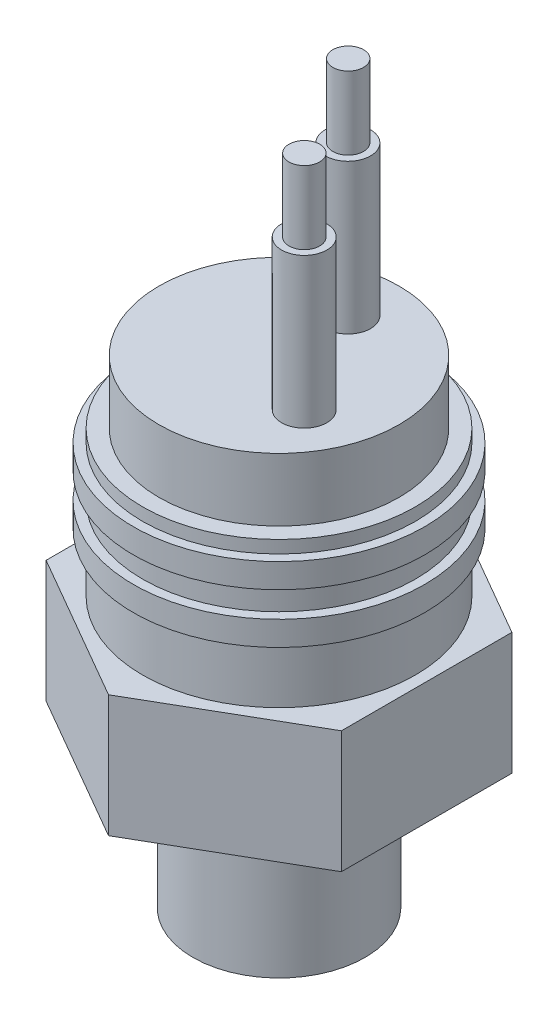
ISO-10303-21;
HEADER;
FILE_DESCRIPTION(('STEP AP214'),'2;1');
FILE_NAME('part.step','',(''),(''),'','','');
FILE_SCHEMA(('AUTOMOTIVE_DESIGN { 1 0 10303 214 1 1 1 1 }'));
ENDSEC;
DATA;
#1=APPLICATION_CONTEXT('core data for automotive mechanical design processes');
#2=APPLICATION_PROTOCOL_DEFINITION('international standard','automotive_design',2000,#1);
#3=PRODUCT_CONTEXT('',#1,'mechanical');
#4=PRODUCT('Part','Part','',(#3));
#5=PRODUCT_RELATED_PRODUCT_CATEGORY('part','',(#4));
#6=PRODUCT_DEFINITION_FORMATION('','',#4);
#7=PRODUCT_DEFINITION_CONTEXT('part definition',#1,'design');
#8=PRODUCT_DEFINITION('design','',#6,#7);
#9=PRODUCT_DEFINITION_SHAPE('','',#8);
#10=(LENGTH_UNIT() NAMED_UNIT(*) SI_UNIT(.MILLI.,.METRE.));
#11=(NAMED_UNIT(*) PLANE_ANGLE_UNIT() SI_UNIT($,.RADIAN.));
#12=(NAMED_UNIT(*) SI_UNIT($,.STERADIAN.) SOLID_ANGLE_UNIT());
#13=UNCERTAINTY_MEASURE_WITH_UNIT(LENGTH_MEASURE(1.E-05),#10,'distance_accuracy_value','');
#14=(GEOMETRIC_REPRESENTATION_CONTEXT(3) GLOBAL_UNCERTAINTY_ASSIGNED_CONTEXT((#13)) GLOBAL_UNIT_ASSIGNED_CONTEXT((#10,
#11,#12)) REPRESENTATION_CONTEXT('',''));
#15=CARTESIAN_POINT('',(0.,0.,0.));
#16=DIRECTION('',(0.,0.,1.));
#17=DIRECTION('',(1.,0.,0.));
#18=AXIS2_PLACEMENT_3D('',#15,#16,#17);
#19=CARTESIAN_POINT('',(-9.52499999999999,0.,-16.4977839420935));
#20=DIRECTION('',(0.,1.,0.));
#21=DIRECTION('',(0.,0.,1.));
#22=AXIS2_PLACEMENT_3D('',#19,#20,#21);
#23=PLANE('',#22);
#24=DIRECTION('',(-0.866025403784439,0.,-0.5));
#25=VECTOR('',#24,1.);
#26=CARTESIAN_POINT('',(9.52499999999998,0.,-5.4992613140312));
#27=LINE('',#26,#25);
#28=CARTESIAN_POINT('',(9.52499999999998,0.,-5.4992613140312));
#29=VERTEX_POINT('',#28);
#30=CARTESIAN_POINT('',(0.,0.,-10.9985226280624));
#31=VERTEX_POINT('',#30);
#32=EDGE_CURVE('E94',#29,#31,#27,.T.);
#33=ORIENTED_EDGE('',*,*,#32,.F.);
#34=DIRECTION('',(0.,0.,-1.));
#35=VECTOR('',#34,1.);
#36=CARTESIAN_POINT('',(9.52499999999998,0.,5.49926131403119));
#37=LINE('',#36,#35);
#38=CARTESIAN_POINT('',(9.52499999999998,0.,5.49926131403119));
#39=VERTEX_POINT('',#38);
#40=EDGE_CURVE('E124',#39,#29,#37,.T.);
#41=ORIENTED_EDGE('',*,*,#40,.F.);
#42=DIRECTION('',(0.866025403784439,0.,-0.5));
#43=VECTOR('',#42,1.);
#44=CARTESIAN_POINT('',(0.,0.,10.9985226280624));
#45=LINE('',#44,#43);
#46=CARTESIAN_POINT('',(0.,0.,10.9985226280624));
#47=VERTEX_POINT('',#46);
#48=EDGE_CURVE('E122',#47,#39,#45,.T.);
#49=ORIENTED_EDGE('',*,*,#48,.F.);
#50=DIRECTION('',(0.866025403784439,0.,0.5));
#51=VECTOR('',#50,1.);
#52=CARTESIAN_POINT('',(-9.52499999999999,0.,5.49926131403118));
#53=LINE('',#52,#51);
#54=CARTESIAN_POINT('',(-9.52499999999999,0.,5.49926131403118));
#55=VERTEX_POINT('',#54);
#56=EDGE_CURVE('E120',#55,#47,#53,.T.);
#57=ORIENTED_EDGE('',*,*,#56,.F.);
#58=DIRECTION('',(0.,0.,1.));
#59=VECTOR('',#58,1.);
#60=CARTESIAN_POINT('',(-9.52499999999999,0.,-5.49926131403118));
#61=LINE('',#60,#59);
#62=CARTESIAN_POINT('',(-9.52499999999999,0.,-5.49926131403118));
#63=VERTEX_POINT('',#62);
#64=EDGE_CURVE('E96',#63,#55,#61,.T.);
#65=ORIENTED_EDGE('',*,*,#64,.F.);
#66=DIRECTION('',(-0.866025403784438,0.,0.5));
#67=VECTOR('',#66,1.);
#68=CARTESIAN_POINT('',(0.,0.,-10.9985226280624));
#69=LINE('',#68,#67);
#70=EDGE_CURVE('E89',#31,#63,#69,.T.);
#71=ORIENTED_EDGE('',*,*,#70,.F.);
#72=EDGE_LOOP('',(#33,#41,#49,#57,#65,#71));
#73=FACE_BOUND('',#72,.T.);
#74=CARTESIAN_POINT('',(0.,0.,0.));
#75=DIRECTION('',(0.,1.,0.));
#76=DIRECTION('',(0.,0.,1.));
#77=AXIS2_PLACEMENT_3D('',#74,#75,#76);
#78=CIRCLE('',#77,7.94336420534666);
#79=CARTESIAN_POINT('',(0.,0.,7.94336420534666));
#80=VERTEX_POINT('',#79);
#81=EDGE_CURVE('E11',#80,#80,#78,.F.);
#82=ORIENTED_EDGE('',*,*,#81,.F.);
#83=EDGE_LOOP('',(#82));
#84=FACE_BOUND('',#83,.T.);
#85=ADVANCED_FACE('F36',(#73,#84),#23,.F.);
#86=CARTESIAN_POINT('',(3.84948291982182,30.988,2.22250000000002));
#87=DIRECTION('',(0.,1.,0.));
#88=DIRECTION('',(0.500000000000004,0.,-0.866025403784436));
#89=AXIS2_PLACEMENT_3D('',#86,#87,#88);
#90=PLANE('',#89);
#91=CARTESIAN_POINT('',(3.84948291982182,30.988,2.22250000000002));
#92=DIRECTION('',(0.,1.,0.));
#93=DIRECTION('',(0.500000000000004,0.,-0.866025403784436));
#94=AXIS2_PLACEMENT_3D('',#91,#92,#93);
#95=CIRCLE('',#94,1.4605);
#96=CARTESIAN_POINT('',(4.57973291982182,30.988,0.957669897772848));
#97=VERTEX_POINT('',#96);
#98=EDGE_CURVE('E303',#97,#97,#95,.T.);
#99=ORIENTED_EDGE('',*,*,#98,.T.);
#100=EDGE_LOOP('',(#99));
#101=FACE_BOUND('',#100,.T.);
#102=CARTESIAN_POINT('',(3.86587986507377,30.988,2.23196678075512));
#103=DIRECTION('',(0.,1.,0.));
#104=DIRECTION('',(0.500000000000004,0.,-0.866025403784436));
#105=AXIS2_PLACEMENT_3D('',#102,#103,#104);
#106=CIRCLE('',#105,0.9906);
#107=CARTESIAN_POINT('',(4.36117986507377,30.988,1.37408201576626));
#108=VERTEX_POINT('',#107);
#109=EDGE_CURVE('E309',#108,#108,#106,.T.);
#110=ORIENTED_EDGE('',*,*,#109,.F.);
#111=EDGE_LOOP('',(#110));
#112=FACE_BOUND('',#111,.T.);
#113=ADVANCED_FACE('F171',(#101,#112),#90,.T.);
#114=CARTESIAN_POINT('',(0.,21.336,0.));
#115=DIRECTION('',(0.,1.,0.));
#116=DIRECTION('',(-1.,0.,0.));
#117=AXIS2_PLACEMENT_3D('',#114,#115,#116);
#118=PLANE('',#117);
#119=CARTESIAN_POINT('',(0.,21.336,-4.445));
#120=DIRECTION('',(0.,1.,0.));
#121=DIRECTION('',(-1.,0.,0.));
#122=AXIS2_PLACEMENT_3D('',#119,#120,#121);
#123=CIRCLE('',#122,1.4605);
#124=CARTESIAN_POINT('',(-1.4605,21.336,-4.445));
#125=VERTEX_POINT('',#124);
#126=EDGE_CURVE('E294',#125,#125,#123,.T.);
#127=ORIENTED_EDGE('',*,*,#126,.F.);
#128=EDGE_LOOP('',(#127));
#129=FACE_BOUND('',#128,.T.);
#130=CARTESIAN_POINT('',(0.,21.336,0.));
#131=DIRECTION('',(0.,1.,0.));
#132=DIRECTION('',(-1.,0.,0.));
#133=AXIS2_PLACEMENT_3D('',#130,#131,#132);
#134=CIRCLE('',#133,7.747);
#135=CARTESIAN_POINT('',(-7.747,21.336,0.));
#136=VERTEX_POINT('',#135);
#137=EDGE_CURVE('E288',#136,#136,#134,.T.);
#138=ORIENTED_EDGE('',*,*,#137,.T.);
#139=EDGE_LOOP('',(#138));
#140=FACE_BOUND('',#139,.T.);
#141=CARTESIAN_POINT('',(3.84948291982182,21.336,2.22250000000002));
#142=DIRECTION('',(0.,1.,0.));
#143=DIRECTION('',(0.500000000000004,0.,-0.866025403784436));
#144=AXIS2_PLACEMENT_3D('',#141,#142,#143);
#145=CIRCLE('',#144,1.4605);
#146=CARTESIAN_POINT('',(4.57973291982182,21.336,0.957669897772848));
#147=VERTEX_POINT('',#146);
#148=EDGE_CURVE('E304',#147,#147,#145,.T.);
#149=ORIENTED_EDGE('',*,*,#148,.F.);
#150=EDGE_LOOP('',(#149));
#151=FACE_BOUND('',#150,.T.);
#152=ADVANCED_FACE('F175',(#129,#140,#151),#118,.T.);
#153=CARTESIAN_POINT('',(0.,30.988,-4.445));
#154=DIRECTION('',(0.,1.,0.));
#155=DIRECTION('',(-1.,0.,0.));
#156=AXIS2_PLACEMENT_3D('',#153,#154,#155);
#157=PLANE('',#156);
#158=CARTESIAN_POINT('',(0.,30.988,-4.445));
#159=DIRECTION('',(0.,1.,0.));
#160=DIRECTION('',(-1.,0.,0.));
#161=AXIS2_PLACEMENT_3D('',#158,#159,#160);
#162=CIRCLE('',#161,1.4605);
#163=CARTESIAN_POINT('',(-1.4605,30.988,-4.445));
#164=VERTEX_POINT('',#163);
#165=EDGE_CURVE('E291',#164,#164,#162,.T.);
#166=ORIENTED_EDGE('',*,*,#165,.T.);
#167=EDGE_LOOP('',(#166));
#168=FACE_BOUND('',#167,.T.);
#169=CARTESIAN_POINT('',(0.,30.988,-4.4639335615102));
#170=DIRECTION('',(0.,1.,0.));
#171=DIRECTION('',(-1.,0.,0.));
#172=AXIS2_PLACEMENT_3D('',#169,#170,#171);
#173=CIRCLE('',#172,0.9906);
#174=CARTESIAN_POINT('',(-0.990600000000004,30.988,-4.4639335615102));
#175=VERTEX_POINT('',#174);
#176=EDGE_CURVE('E300',#175,#175,#173,.T.);
#177=ORIENTED_EDGE('',*,*,#176,.F.);
#178=EDGE_LOOP('',(#177));
#179=FACE_BOUND('',#178,.T.);
#180=ADVANCED_FACE('F181',(#168,#179),#157,.T.);
#181=CARTESIAN_POINT('',(8.8011,17.272,0.));
#182=DIRECTION('',(0.,-1.,0.));
#183=DIRECTION('',(1.,0.,0.));
#184=AXIS2_PLACEMENT_3D('',#181,#182,#183);
#185=PLANE('',#184);
#186=CARTESIAN_POINT('',(0.,17.272,0.));
#187=DIRECTION('',(0.,1.,0.));
#188=DIRECTION('',(-1.,0.,0.));
#189=AXIS2_PLACEMENT_3D('',#186,#187,#188);
#190=CIRCLE('',#189,8.8011);
#191=CARTESIAN_POINT('',(-8.8011,17.272,0.));
#192=VERTEX_POINT('',#191);
#193=EDGE_CURVE('E112',#192,#192,#190,.T.);
#194=ORIENTED_EDGE('',*,*,#193,.T.);
#195=EDGE_LOOP('',(#194));
#196=FACE_BOUND('',#195,.T.);
#197=CARTESIAN_POINT('',(0.,17.272,0.));
#198=DIRECTION('',(0.,-1.,0.));
#199=DIRECTION('',(1.,0.,0.));
#200=AXIS2_PLACEMENT_3D('',#197,#198,#199);
#201=CIRCLE('',#200,7.747);
#202=CARTESIAN_POINT('',(7.747,17.272,0.));
#203=VERTEX_POINT('',#202);
#204=EDGE_CURVE('E107',#203,#203,#201,.F.);
#205=ORIENTED_EDGE('',*,*,#204,.F.);
#206=EDGE_LOOP('',(#205));
#207=FACE_BOUND('',#206,.T.);
#208=ADVANCED_FACE('F205',(#196,#207),#185,.F.);
#209=CARTESIAN_POINT('',(-9.52499999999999,7.874,-16.4977839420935));
#210=DIRECTION('',(0.,1.,0.));
#211=DIRECTION('',(0.,0.,1.));
#212=AXIS2_PLACEMENT_3D('',#209,#210,#211);
#213=PLANE('',#212);
#214=DIRECTION('',(-0.866025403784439,0.,-0.5));
#215=VECTOR('',#214,1.);
#216=CARTESIAN_POINT('',(9.52499999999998,7.874,-5.4992613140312));
#217=LINE('',#216,#215);
#218=CARTESIAN_POINT('',(9.52499999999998,7.874,-5.4992613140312));
#219=VERTEX_POINT('',#218);
#220=CARTESIAN_POINT('',(0.,7.874,-10.9985226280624));
#221=VERTEX_POINT('',#220);
#222=EDGE_CURVE('E126',#219,#221,#217,.T.);
#223=ORIENTED_EDGE('',*,*,#222,.T.);
#224=DIRECTION('',(-0.866025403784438,0.,0.5));
#225=VECTOR('',#224,1.);
#226=CARTESIAN_POINT('',(0.,7.874,-10.9985226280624));
#227=LINE('',#226,#225);
#228=CARTESIAN_POINT('',(-9.52499999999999,7.874,-5.49926131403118));
#229=VERTEX_POINT('',#228);
#230=EDGE_CURVE('E104',#221,#229,#227,.T.);
#231=ORIENTED_EDGE('',*,*,#230,.T.);
#232=DIRECTION('',(0.,0.,1.));
#233=VECTOR('',#232,1.);
#234=CARTESIAN_POINT('',(-9.52499999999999,7.874,-5.49926131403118));
#235=LINE('',#234,#233);
#236=CARTESIAN_POINT('',(-9.52499999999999,7.874,5.49926131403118));
#237=VERTEX_POINT('',#236);
#238=EDGE_CURVE('E129',#229,#237,#235,.T.);
#239=ORIENTED_EDGE('',*,*,#238,.T.);
#240=DIRECTION('',(0.866025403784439,0.,0.5));
#241=VECTOR('',#240,1.);
#242=CARTESIAN_POINT('',(-9.52499999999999,7.874,5.49926131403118));
#243=LINE('',#242,#241);
#244=CARTESIAN_POINT('',(0.,7.874,10.9985226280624));
#245=VERTEX_POINT('',#244);
#246=EDGE_CURVE('E131',#237,#245,#243,.T.);
#247=ORIENTED_EDGE('',*,*,#246,.T.);
#248=DIRECTION('',(0.866025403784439,0.,-0.5));
#249=VECTOR('',#248,1.);
#250=CARTESIAN_POINT('',(0.,7.874,10.9985226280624));
#251=LINE('',#250,#249);
#252=CARTESIAN_POINT('',(9.52499999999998,7.874,5.49926131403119));
#253=VERTEX_POINT('',#252);
#254=EDGE_CURVE('E56',#245,#253,#251,.T.);
#255=ORIENTED_EDGE('',*,*,#254,.T.);
#256=DIRECTION('',(0.,0.,-1.));
#257=VECTOR('',#256,1.);
#258=CARTESIAN_POINT('',(9.52499999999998,7.874,5.49926131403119));
#259=LINE('',#258,#257);
#260=EDGE_CURVE('E51',#253,#219,#259,.T.);
#261=ORIENTED_EDGE('',*,*,#260,.T.);
#262=EDGE_LOOP('',(#223,#231,#239,#247,#255,#261));
#263=FACE_BOUND('',#262,.T.);
#264=CARTESIAN_POINT('',(0.,7.874,0.));
#265=DIRECTION('',(0.,1.,0.));
#266=DIRECTION('',(-1.,0.,0.));
#267=AXIS2_PLACEMENT_3D('',#264,#265,#266);
#268=CIRCLE('',#267,8.8011);
#269=CARTESIAN_POINT('',(-8.8011,7.874,0.));
#270=VERTEX_POINT('',#269);
#271=EDGE_CURVE('E285',#270,#270,#268,.T.);
#272=ORIENTED_EDGE('',*,*,#271,.F.);
#273=EDGE_LOOP('',(#272));
#274=FACE_BOUND('',#273,.T.);
#275=ADVANCED_FACE('F251',(#263,#274),#213,.T.);
#276=CARTESIAN_POINT('',(9.52499999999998,7.874,-5.4992613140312));
#277=DIRECTION('',(-0.5,0.,0.866025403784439));
#278=DIRECTION('',(0.866025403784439,0.,0.5));
#279=AXIS2_PLACEMENT_3D('',#276,#277,#278);
#280=PLANE('',#279);
#281=ORIENTED_EDGE('',*,*,#32,.T.);
#282=DIRECTION('',(0.,-1.,0.));
#283=VECTOR('',#282,1.);
#284=CARTESIAN_POINT('',(0.,7.874,-10.9985226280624));
#285=LINE('',#284,#283);
#286=EDGE_CURVE('E102',#221,#31,#285,.T.);
#287=ORIENTED_EDGE('',*,*,#286,.F.);
#288=ORIENTED_EDGE('',*,*,#222,.F.);
#289=DIRECTION('',(0.,-1.,0.));
#290=VECTOR('',#289,1.);
#291=CARTESIAN_POINT('',(9.52499999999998,7.874,-5.4992613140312));
#292=LINE('',#291,#290);
#293=EDGE_CURVE('E111',#219,#29,#292,.T.);
#294=ORIENTED_EDGE('',*,*,#293,.T.);
#295=EDGE_LOOP('',(#281,#287,#288,#294));
#296=FACE_BOUND('',#295,.T.);
#297=ADVANCED_FACE('F38',(#296),#280,.F.);
#298=CARTESIAN_POINT('',(0.,7.874,-10.9985226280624));
#299=DIRECTION('',(0.5,0.,0.866025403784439));
#300=DIRECTION('',(0.866025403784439,0.,-0.5));
#301=AXIS2_PLACEMENT_3D('',#298,#299,#300);
#302=PLANE('',#301);
#303=ORIENTED_EDGE('',*,*,#70,.T.);
#304=DIRECTION('',(0.,-1.,0.));
#305=VECTOR('',#304,1.);
#306=CARTESIAN_POINT('',(-9.52499999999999,7.874,-5.49926131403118));
#307=LINE('',#306,#305);
#308=EDGE_CURVE('E108',#229,#63,#307,.T.);
#309=ORIENTED_EDGE('',*,*,#308,.F.);
#310=ORIENTED_EDGE('',*,*,#230,.F.);
#311=ORIENTED_EDGE('',*,*,#286,.T.);
#312=EDGE_LOOP('',(#303,#309,#310,#311));
#313=FACE_BOUND('',#312,.T.);
#314=ADVANCED_FACE('F103',(#313),#302,.F.);
#315=CARTESIAN_POINT('',(-9.52499999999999,7.874,-5.49926131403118));
#316=DIRECTION('',(1.,0.,0.));
#317=DIRECTION('',(0.,0.,-1.));
#318=AXIS2_PLACEMENT_3D('',#315,#316,#317);
#319=PLANE('',#318);
#320=ORIENTED_EDGE('',*,*,#64,.T.);
#321=DIRECTION('',(0.,-1.,0.));
#322=VECTOR('',#321,1.);
#323=CARTESIAN_POINT('',(-9.52499999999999,7.874,5.49926131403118));
#324=LINE('',#323,#322);
#325=EDGE_CURVE('E142',#237,#55,#324,.T.);
#326=ORIENTED_EDGE('',*,*,#325,.F.);
#327=ORIENTED_EDGE('',*,*,#238,.F.);
#328=ORIENTED_EDGE('',*,*,#308,.T.);
#329=EDGE_LOOP('',(#320,#326,#327,#328));
#330=FACE_BOUND('',#329,.T.);
#331=ADVANCED_FACE('F418',(#330),#319,.F.);
#332=CARTESIAN_POINT('',(-9.52499999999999,7.874,5.49926131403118));
#333=DIRECTION('',(0.5,0.,-0.866025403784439));
#334=DIRECTION('',(-0.866025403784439,0.,-0.5));
#335=AXIS2_PLACEMENT_3D('',#332,#333,#334);
#336=PLANE('',#335);
#337=ORIENTED_EDGE('',*,*,#56,.T.);
#338=DIRECTION('',(0.,-1.,0.));
#339=VECTOR('',#338,1.);
#340=CARTESIAN_POINT('',(0.,7.874,10.9985226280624));
#341=LINE('',#340,#339);
#342=EDGE_CURVE('E139',#245,#47,#341,.T.);
#343=ORIENTED_EDGE('',*,*,#342,.F.);
#344=ORIENTED_EDGE('',*,*,#246,.F.);
#345=ORIENTED_EDGE('',*,*,#325,.T.);
#346=EDGE_LOOP('',(#337,#343,#344,#345));
#347=FACE_BOUND('',#346,.T.);
#348=ADVANCED_FACE('F410',(#347),#336,.F.);
#349=CARTESIAN_POINT('',(0.,7.874,10.9985226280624));
#350=DIRECTION('',(-0.5,0.,-0.866025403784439));
#351=DIRECTION('',(-0.866025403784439,0.,0.5));
#352=AXIS2_PLACEMENT_3D('',#349,#350,#351);
#353=PLANE('',#352);
#354=ORIENTED_EDGE('',*,*,#48,.T.);
#355=DIRECTION('',(0.,-1.,0.));
#356=VECTOR('',#355,1.);
#357=CARTESIAN_POINT('',(9.52499999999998,7.874,5.49926131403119));
#358=LINE('',#357,#356);
#359=EDGE_CURVE('E136',#253,#39,#358,.T.);
#360=ORIENTED_EDGE('',*,*,#359,.F.);
#361=ORIENTED_EDGE('',*,*,#254,.F.);
#362=ORIENTED_EDGE('',*,*,#342,.T.);
#363=EDGE_LOOP('',(#354,#360,#361,#362));
#364=FACE_BOUND('',#363,.T.);
#365=ADVANCED_FACE('F402',(#364),#353,.F.);
#366=CARTESIAN_POINT('',(9.52499999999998,7.874,5.49926131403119));
#367=DIRECTION('',(-1.,0.,0.));
#368=DIRECTION('',(0.,0.,1.));
#369=AXIS2_PLACEMENT_3D('',#366,#367,#368);
#370=PLANE('',#369);
#371=ORIENTED_EDGE('',*,*,#40,.T.);
#372=ORIENTED_EDGE('',*,*,#293,.F.);
#373=ORIENTED_EDGE('',*,*,#260,.F.);
#374=ORIENTED_EDGE('',*,*,#359,.T.);
#375=EDGE_LOOP('',(#371,#372,#373,#374));
#376=FACE_BOUND('',#375,.T.);
#377=ADVANCED_FACE('F248',(#376),#370,.F.);
#378=CARTESIAN_POINT('',(0.,0.,0.));
#379=DIRECTION('',(0.,1.,0.));
#380=DIRECTION('',(-1.,0.,0.));
#381=AXIS2_PLACEMENT_3D('',#378,#379,#380);
#382=CYLINDRICAL_SURFACE('',#381,8.8011);
#383=ORIENTED_EDGE('',*,*,#193,.F.);
#384=EDGE_LOOP('',(#383));
#385=FACE_BOUND('',#384,.T.);
#386=CARTESIAN_POINT('',(0.,16.4592,0.));
#387=DIRECTION('',(0.,1.,0.));
#388=DIRECTION('',(-1.,0.,0.));
#389=AXIS2_PLACEMENT_3D('',#386,#387,#388);
#390=CIRCLE('',#389,8.8011);
#391=CARTESIAN_POINT('',(-8.8011,16.4592,0.));
#392=VERTEX_POINT('',#391);
#393=EDGE_CURVE('E115',#392,#392,#390,.T.);
#394=ORIENTED_EDGE('',*,*,#393,.T.);
#395=EDGE_LOOP('',(#394));
#396=FACE_BOUND('',#395,.T.);
#397=ADVANCED_FACE('F245',(#385,#396),#382,.T.);
#398=CARTESIAN_POINT('',(9.398,16.4592,0.));
#399=DIRECTION('',(0.,-1.,0.));
#400=DIRECTION('',(1.,0.,0.));
#401=AXIS2_PLACEMENT_3D('',#398,#399,#400);
#402=PLANE('',#401);
#403=ORIENTED_EDGE('',*,*,#393,.F.);
#404=EDGE_LOOP('',(#403));
#405=FACE_BOUND('',#404,.T.);
#406=CARTESIAN_POINT('',(0.,16.4592,0.));
#407=DIRECTION('',(0.,1.,0.));
#408=DIRECTION('',(-1.,0.,0.));
#409=AXIS2_PLACEMENT_3D('',#406,#407,#408);
#410=CIRCLE('',#409,9.398);
#411=CARTESIAN_POINT('',(-9.398,16.4592,0.));
#412=VERTEX_POINT('',#411);
#413=EDGE_CURVE('E263',#412,#412,#410,.T.);
#414=ORIENTED_EDGE('',*,*,#413,.T.);
#415=EDGE_LOOP('',(#414));
#416=FACE_BOUND('',#415,.T.);
#417=ADVANCED_FACE('F241',(#405,#416),#402,.F.);
#418=CARTESIAN_POINT('',(0.,0.,0.));
#419=DIRECTION('',(0.,1.,0.));
#420=DIRECTION('',(-1.,0.,0.));
#421=AXIS2_PLACEMENT_3D('',#418,#419,#420);
#422=CYLINDRICAL_SURFACE('',#421,9.398);
#423=ORIENTED_EDGE('',*,*,#413,.F.);
#424=EDGE_LOOP('',(#423));
#425=FACE_BOUND('',#424,.T.);
#426=CARTESIAN_POINT('',(0.,14.8844,0.));
#427=DIRECTION('',(0.,1.,0.));
#428=DIRECTION('',(-1.,0.,0.));
#429=AXIS2_PLACEMENT_3D('',#426,#427,#428);
#430=CIRCLE('',#429,9.398);
#431=CARTESIAN_POINT('',(-9.398,14.8844,0.));
#432=VERTEX_POINT('',#431);
#433=EDGE_CURVE('E265',#432,#432,#430,.T.);
#434=ORIENTED_EDGE('',*,*,#433,.T.);
#435=EDGE_LOOP('',(#434));
#436=FACE_BOUND('',#435,.T.);
#437=ADVANCED_FACE('F237',(#425,#436),#422,.T.);
#438=CARTESIAN_POINT('',(8.8011,14.8844,0.));
#439=DIRECTION('',(0.,1.,0.));
#440=DIRECTION('',(-1.,0.,0.));
#441=AXIS2_PLACEMENT_3D('',#438,#439,#440);
#442=PLANE('',#441);
#443=ORIENTED_EDGE('',*,*,#433,.F.);
#444=EDGE_LOOP('',(#443));
#445=FACE_BOUND('',#444,.T.);
#446=CARTESIAN_POINT('',(0.,14.8844,0.));
#447=DIRECTION('',(0.,1.,0.));
#448=DIRECTION('',(-1.,0.,0.));
#449=AXIS2_PLACEMENT_3D('',#446,#447,#448);
#450=CIRCLE('',#449,8.8011);
#451=CARTESIAN_POINT('',(-8.8011,14.8844,0.));
#452=VERTEX_POINT('',#451);
#453=EDGE_CURVE('E270',#452,#452,#450,.T.);
#454=ORIENTED_EDGE('',*,*,#453,.T.);
#455=EDGE_LOOP('',(#454));
#456=FACE_BOUND('',#455,.T.);
#457=ADVANCED_FACE('F233',(#445,#456),#442,.F.);
#458=CARTESIAN_POINT('',(0.,0.,0.));
#459=DIRECTION('',(0.,1.,0.));
#460=DIRECTION('',(-1.,0.,0.));
#461=AXIS2_PLACEMENT_3D('',#458,#459,#460);
#462=CYLINDRICAL_SURFACE('',#461,8.8011);
#463=ORIENTED_EDGE('',*,*,#453,.F.);
#464=EDGE_LOOP('',(#463));
#465=FACE_BOUND('',#464,.T.);
#466=CARTESIAN_POINT('',(0.,13.2334,0.));
#467=DIRECTION('',(0.,1.,0.));
#468=DIRECTION('',(-1.,0.,0.));
#469=AXIS2_PLACEMENT_3D('',#466,#467,#468);
#470=CIRCLE('',#469,8.8011);
#471=CARTESIAN_POINT('',(-8.8011,13.2334,0.));
#472=VERTEX_POINT('',#471);
#473=EDGE_CURVE('E273',#472,#472,#470,.T.);
#474=ORIENTED_EDGE('',*,*,#473,.T.);
#475=EDGE_LOOP('',(#474));
#476=FACE_BOUND('',#475,.T.);
#477=ADVANCED_FACE('F229',(#465,#476),#462,.T.);
#478=CARTESIAN_POINT('',(9.398,13.2334,0.));
#479=DIRECTION('',(0.,-1.,0.));
#480=DIRECTION('',(1.,0.,0.));
#481=AXIS2_PLACEMENT_3D('',#478,#479,#480);
#482=PLANE('',#481);
#483=ORIENTED_EDGE('',*,*,#473,.F.);
#484=EDGE_LOOP('',(#483));
#485=FACE_BOUND('',#484,.T.);
#486=CARTESIAN_POINT('',(0.,13.2334,0.));
#487=DIRECTION('',(0.,1.,0.));
#488=DIRECTION('',(-1.,0.,0.));
#489=AXIS2_PLACEMENT_3D('',#486,#487,#488);
#490=CIRCLE('',#489,9.398);
#491=CARTESIAN_POINT('',(-9.398,13.2334,0.));
#492=VERTEX_POINT('',#491);
#493=EDGE_CURVE('E276',#492,#492,#490,.T.);
#494=ORIENTED_EDGE('',*,*,#493,.T.);
#495=EDGE_LOOP('',(#494));
#496=FACE_BOUND('',#495,.T.);
#497=ADVANCED_FACE('F225',(#485,#496),#482,.F.);
#498=CARTESIAN_POINT('',(0.,0.,0.));
#499=DIRECTION('',(0.,1.,0.));
#500=DIRECTION('',(-1.,0.,0.));
#501=AXIS2_PLACEMENT_3D('',#498,#499,#500);
#502=CYLINDRICAL_SURFACE('',#501,9.398);
#503=ORIENTED_EDGE('',*,*,#493,.F.);
#504=EDGE_LOOP('',(#503));
#505=FACE_BOUND('',#504,.T.);
#506=CARTESIAN_POINT('',(0.,11.6586,0.));
#507=DIRECTION('',(0.,1.,0.));
#508=DIRECTION('',(-1.,0.,0.));
#509=AXIS2_PLACEMENT_3D('',#506,#507,#508);
#510=CIRCLE('',#509,9.398);
#511=CARTESIAN_POINT('',(-9.398,11.6586,0.));
#512=VERTEX_POINT('',#511);
#513=EDGE_CURVE('E279',#512,#512,#510,.T.);
#514=ORIENTED_EDGE('',*,*,#513,.T.);
#515=EDGE_LOOP('',(#514));
#516=FACE_BOUND('',#515,.T.);
#517=ADVANCED_FACE('F221',(#505,#516),#502,.T.);
#518=CARTESIAN_POINT('',(8.80109999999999,11.6586,0.));
#519=DIRECTION('',(0.,1.,0.));
#520=DIRECTION('',(-1.,0.,0.));
#521=AXIS2_PLACEMENT_3D('',#518,#519,#520);
#522=PLANE('',#521);
#523=ORIENTED_EDGE('',*,*,#513,.F.);
#524=EDGE_LOOP('',(#523));
#525=FACE_BOUND('',#524,.T.);
#526=CARTESIAN_POINT('',(0.,11.6586,0.));
#527=DIRECTION('',(0.,1.,0.));
#528=DIRECTION('',(-1.,0.,0.));
#529=AXIS2_PLACEMENT_3D('',#526,#527,#528);
#530=CIRCLE('',#529,8.8011);
#531=CARTESIAN_POINT('',(-8.8011,11.6586,0.));
#532=VERTEX_POINT('',#531);
#533=EDGE_CURVE('E282',#532,#532,#530,.T.);
#534=ORIENTED_EDGE('',*,*,#533,.T.);
#535=EDGE_LOOP('',(#534));
#536=FACE_BOUND('',#535,.T.);
#537=ADVANCED_FACE('F217',(#525,#536),#522,.F.);
#538=CARTESIAN_POINT('',(0.,0.,0.));
#539=DIRECTION('',(0.,1.,0.));
#540=DIRECTION('',(-1.,0.,0.));
#541=AXIS2_PLACEMENT_3D('',#538,#539,#540);
#542=CYLINDRICAL_SURFACE('',#541,8.8011);
#543=ORIENTED_EDGE('',*,*,#533,.F.);
#544=EDGE_LOOP('',(#543));
#545=FACE_BOUND('',#544,.T.);
#546=ORIENTED_EDGE('',*,*,#271,.T.);
#547=EDGE_LOOP('',(#546));
#548=FACE_BOUND('',#547,.T.);
#549=ADVANCED_FACE('F213',(#545,#548),#542,.T.);
#550=CARTESIAN_POINT('',(0.,21.336,0.));
#551=DIRECTION('',(0.,-1.,0.));
#552=DIRECTION('',(1.,0.,0.));
#553=AXIS2_PLACEMENT_3D('',#550,#551,#552);
#554=CYLINDRICAL_SURFACE('',#553,7.747);
#555=ORIENTED_EDGE('',*,*,#137,.F.);
#556=EDGE_LOOP('',(#555));
#557=FACE_BOUND('',#556,.T.);
#558=ORIENTED_EDGE('',*,*,#204,.T.);
#559=EDGE_LOOP('',(#558));
#560=FACE_BOUND('',#559,.T.);
#561=ADVANCED_FACE('F208',(#557,#560),#554,.T.);
#562=CARTESIAN_POINT('',(0.,30.988,-4.445));
#563=DIRECTION('',(0.,-1.,0.));
#564=DIRECTION('',(1.,0.,0.));
#565=AXIS2_PLACEMENT_3D('',#562,#563,#564);
#566=CYLINDRICAL_SURFACE('',#565,1.4605);
#567=ORIENTED_EDGE('',*,*,#165,.F.);
#568=EDGE_LOOP('',(#567));
#569=FACE_BOUND('',#568,.T.);
#570=ORIENTED_EDGE('',*,*,#126,.T.);
#571=EDGE_LOOP('',(#570));
#572=FACE_BOUND('',#571,.T.);
#573=ADVANCED_FACE('F201',(#569,#572),#566,.T.);
#574=CARTESIAN_POINT('',(0.,35.687,-4.4639335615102));
#575=DIRECTION('',(0.,-1.,0.));
#576=DIRECTION('',(1.,0.,0.));
#577=AXIS2_PLACEMENT_3D('',#574,#575,#576);
#578=CYLINDRICAL_SURFACE('',#577,0.9906);
#579=CARTESIAN_POINT('',(0.,35.687,-4.4639335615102));
#580=DIRECTION('',(0.,1.,0.));
#581=DIRECTION('',(-1.,0.,0.));
#582=AXIS2_PLACEMENT_3D('',#579,#580,#581);
#583=CIRCLE('',#582,0.9906);
#584=CARTESIAN_POINT('',(-0.990600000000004,35.687,-4.4639335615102));
#585=VERTEX_POINT('',#584);
#586=EDGE_CURVE('E297',#585,#585,#583,.T.);
#587=ORIENTED_EDGE('',*,*,#586,.F.);
#588=EDGE_LOOP('',(#587));
#589=FACE_BOUND('',#588,.T.);
#590=ORIENTED_EDGE('',*,*,#176,.T.);
#591=EDGE_LOOP('',(#590));
#592=FACE_BOUND('',#591,.T.);
#593=ADVANCED_FACE('F197',(#589,#592),#578,.T.);
#594=CARTESIAN_POINT('',(0.,35.687,-4.4639335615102));
#595=DIRECTION('',(0.,1.,0.));
#596=DIRECTION('',(-1.,0.,0.));
#597=AXIS2_PLACEMENT_3D('',#594,#595,#596);
#598=PLANE('',#597);
#599=ORIENTED_EDGE('',*,*,#586,.T.);
#600=EDGE_LOOP('',(#599));
#601=FACE_BOUND('',#600,.T.);
#602=ADVANCED_FACE('F193',(#601),#598,.T.);
#603=CARTESIAN_POINT('',(3.84948291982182,30.988,2.22250000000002));
#604=DIRECTION('',(0.,-1.,0.));
#605=DIRECTION('',(1.,0.,0.));
#606=AXIS2_PLACEMENT_3D('',#603,#604,#605);
#607=CYLINDRICAL_SURFACE('',#606,1.4605);
#608=ORIENTED_EDGE('',*,*,#98,.F.);
#609=EDGE_LOOP('',(#608));
#610=FACE_BOUND('',#609,.T.);
#611=ORIENTED_EDGE('',*,*,#148,.T.);
#612=EDGE_LOOP('',(#611));
#613=FACE_BOUND('',#612,.T.);
#614=ADVANCED_FACE('F190',(#610,#613),#607,.T.);
#615=CARTESIAN_POINT('',(3.86587986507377,35.687,2.23196678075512));
#616=DIRECTION('',(0.,-1.,0.));
#617=DIRECTION('',(1.,0.,0.));
#618=AXIS2_PLACEMENT_3D('',#615,#616,#617);
#619=CYLINDRICAL_SURFACE('',#618,0.9906);
#620=CARTESIAN_POINT('',(3.86587986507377,35.687,2.23196678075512));
#621=DIRECTION('',(0.,1.,0.));
#622=DIRECTION('',(0.500000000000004,0.,-0.866025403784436));
#623=AXIS2_PLACEMENT_3D('',#620,#621,#622);
#624=CIRCLE('',#623,0.9906);
#625=CARTESIAN_POINT('',(4.36117986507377,35.687,1.37408201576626));
#626=VERTEX_POINT('',#625);
#627=EDGE_CURVE('E307',#626,#626,#624,.T.);
#628=ORIENTED_EDGE('',*,*,#627,.F.);
#629=EDGE_LOOP('',(#628));
#630=FACE_BOUND('',#629,.T.);
#631=ORIENTED_EDGE('',*,*,#109,.T.);
#632=EDGE_LOOP('',(#631));
#633=FACE_BOUND('',#632,.T.);
#634=ADVANCED_FACE('F188',(#630,#633),#619,.T.);
#635=CARTESIAN_POINT('',(3.86587986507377,35.687,2.23196678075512));
#636=DIRECTION('',(0.,1.,0.));
#637=DIRECTION('',(0.500000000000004,0.,-0.866025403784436));
#638=AXIS2_PLACEMENT_3D('',#635,#636,#637);
#639=PLANE('',#638);
#640=ORIENTED_EDGE('',*,*,#627,.T.);
#641=EDGE_LOOP('',(#640));
#642=FACE_BOUND('',#641,.T.);
#643=ADVANCED_FACE('F324',(#642),#639,.T.);
#644=CARTESIAN_POINT('',(0.,0.284318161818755,0.));
#645=DIRECTION('',(0.,1.,0.));
#646=DIRECTION('',(-1.,0.,0.));
#647=AXIS2_PLACEMENT_3D('',#644,#645,#646);
#648=TOROIDAL_SURFACE('',#647,7.1,0.89);
#649=CARTESIAN_POINT('',(0.,0.,0.));
#650=DIRECTION('',(0.,-1.,0.));
#651=DIRECTION('',(0.,0.,-1.));
#652=AXIS2_PLACEMENT_3D('',#649,#650,#651);
#653=CIRCLE('',#652,6.25663579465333);
#654=CARTESIAN_POINT('',(0.,0.,-6.25663579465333));
#655=VERTEX_POINT('',#654);
#656=EDGE_CURVE('E44',#655,#655,#653,.F.);
#657=ORIENTED_EDGE('',*,*,#656,.T.);
#658=EDGE_LOOP('',(#657));
#659=FACE_BOUND('',#658,.T.);
#660=ORIENTED_EDGE('',*,*,#81,.T.);
#661=EDGE_LOOP('',(#660));
#662=FACE_BOUND('',#661,.T.);
#663=ADVANCED_FACE('F153',(#659,#662),#648,.T.);
#664=CARTESIAN_POINT('',(0.,-9.525,0.));
#665=DIRECTION('',(0.,-1.,0.));
#666=DIRECTION('',(0.,0.,-1.));
#667=AXIS2_PLACEMENT_3D('',#664,#665,#666);
#668=PLANE('',#667);
#669=CARTESIAN_POINT('',(0.,-9.525,0.));
#670=DIRECTION('',(0.,-1.,0.));
#671=DIRECTION('',(0.,0.,-1.));
#672=AXIS2_PLACEMENT_3D('',#669,#670,#671);
#673=CIRCLE('',#672,5.55625);
#674=CARTESIAN_POINT('',(0.,-9.525,5.55625));
#675=VERTEX_POINT('',#674);
#676=EDGE_CURVE('E312',#675,#675,#673,.T.);
#677=ORIENTED_EDGE('',*,*,#676,.T.);
#678=EDGE_LOOP('',(#677));
#679=FACE_BOUND('',#678,.T.);
#680=ADVANCED_FACE('F164',(#679),#668,.T.);
#681=CARTESIAN_POINT('',(0.,-9.525,0.));
#682=DIRECTION('',(0.,1.,0.));
#683=DIRECTION('',(0.,0.,1.));
#684=AXIS2_PLACEMENT_3D('',#681,#682,#683);
#685=CYLINDRICAL_SURFACE('',#684,5.55625);
#686=CARTESIAN_POINT('',(0.,0.,0.));
#687=DIRECTION('',(0.,1.,0.));
#688=DIRECTION('',(0.,0.,1.));
#689=AXIS2_PLACEMENT_3D('',#686,#687,#688);
#690=CIRCLE('',#689,5.55625);
#691=CARTESIAN_POINT('',(0.,0.,5.55625));
#692=VERTEX_POINT('',#691);
#693=EDGE_CURVE('E148',#692,#692,#690,.F.);
#694=CARTESIAN_POINT('',(0.,-9.525,5.55625));
#695=CARTESIAN_POINT('',(0.,-9.42578125,5.55625));
#696=CARTESIAN_POINT('',(0.,-9.3265625,5.55625));
#697=CARTESIAN_POINT('',(0.,-9.128125,5.55625));
#698=CARTESIAN_POINT('',(0.,-9.02890625,5.55625));
#699=CARTESIAN_POINT('',(0.,-8.83046875,5.55625));
#700=CARTESIAN_POINT('',(0.,-8.73125,5.55625));
#701=CARTESIAN_POINT('',(0.,-8.5328125,5.55625));
#702=CARTESIAN_POINT('',(0.,-8.43359375,5.55625));
#703=CARTESIAN_POINT('',(0.,-8.23515625,5.55625));
#704=CARTESIAN_POINT('',(0.,-8.1359375,5.55625));
#705=CARTESIAN_POINT('',(0.,-7.9375,5.55625));
#706=CARTESIAN_POINT('',(0.,-7.83828125,5.55625));
#707=CARTESIAN_POINT('',(0.,-7.63984375,5.55625));
#708=CARTESIAN_POINT('',(0.,-7.540625,5.55625));
#709=CARTESIAN_POINT('',(0.,-7.3421875,5.55625));
#710=CARTESIAN_POINT('',(0.,-7.24296875,5.55625));
#711=CARTESIAN_POINT('',(0.,-7.04453125,5.55625));
#712=CARTESIAN_POINT('',(0.,-6.9453125,5.55625));
#713=CARTESIAN_POINT('',(0.,-6.746875,5.55625));
#714=CARTESIAN_POINT('',(0.,-6.64765625,5.55625));
#715=CARTESIAN_POINT('',(0.,-6.44921875,5.55625));
#716=CARTESIAN_POINT('',(0.,-6.35,5.55625));
#717=CARTESIAN_POINT('',(0.,-6.1515625,5.55625));
#718=CARTESIAN_POINT('',(0.,-6.05234375,5.55625));
#719=CARTESIAN_POINT('',(0.,-5.85390625,5.55625));
#720=CARTESIAN_POINT('',(0.,-5.7546875,5.55625));
#721=CARTESIAN_POINT('',(0.,-5.55625,5.55625));
#722=CARTESIAN_POINT('',(0.,-5.45703125,5.55625));
#723=CARTESIAN_POINT('',(0.,-5.25859375,5.55625));
#724=CARTESIAN_POINT('',(0.,-5.159375,5.55625));
#725=CARTESIAN_POINT('',(0.,-4.9609375,5.55625));
#726=CARTESIAN_POINT('',(0.,-4.86171875,5.55625));
#727=CARTESIAN_POINT('',(0.,-4.66328125,5.55625));
#728=CARTESIAN_POINT('',(0.,-4.5640625,5.55625));
#729=CARTESIAN_POINT('',(0.,-4.365625,5.55625));
#730=CARTESIAN_POINT('',(0.,-4.26640625,5.55625));
#731=CARTESIAN_POINT('',(0.,-4.06796875,5.55625));
#732=CARTESIAN_POINT('',(0.,-3.96875,5.55625));
#733=CARTESIAN_POINT('',(0.,-3.7703125,5.55625));
#734=CARTESIAN_POINT('',(0.,-3.67109375,5.55625));
#735=CARTESIAN_POINT('',(0.,-3.47265625,5.55625));
#736=CARTESIAN_POINT('',(0.,-3.3734375,5.55625));
#737=CARTESIAN_POINT('',(0.,-3.175,5.55625));
#738=CARTESIAN_POINT('',(0.,-3.07578125,5.55625));
#739=CARTESIAN_POINT('',(0.,-2.87734375,5.55625));
#740=CARTESIAN_POINT('',(0.,-2.778125,5.55625));
#741=CARTESIAN_POINT('',(0.,-2.5796875,5.55625));
#742=CARTESIAN_POINT('',(0.,-2.48046875,5.55625));
#743=CARTESIAN_POINT('',(0.,-2.28203125,5.55625));
#744=CARTESIAN_POINT('',(0.,-2.1828125,5.55625));
#745=CARTESIAN_POINT('',(0.,-1.984375,5.55625));
#746=CARTESIAN_POINT('',(0.,-1.88515625,5.55625));
#747=CARTESIAN_POINT('',(0.,-1.68671875,5.55625));
#748=CARTESIAN_POINT('',(0.,-1.5875,5.55625));
#749=CARTESIAN_POINT('',(0.,-1.3890625,5.55625));
#750=CARTESIAN_POINT('',(0.,-1.28984375,5.55625));
#751=CARTESIAN_POINT('',(0.,-1.09140625,5.55625));
#752=CARTESIAN_POINT('',(0.,-0.992187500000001,5.55625));
#753=CARTESIAN_POINT('',(0.,-0.793750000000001,5.55625));
#754=CARTESIAN_POINT('',(0.,-0.69453125,5.55625));
#755=CARTESIAN_POINT('',(0.,-0.49609375,5.55625));
#756=CARTESIAN_POINT('',(0.,-0.396875,5.55625));
#757=CARTESIAN_POINT('',(0.,-0.1984375,5.55625));
#758=CARTESIAN_POINT('',(0.,-0.0992187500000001,5.55625));
#759=CARTESIAN_POINT('',(0.,0.,5.55625));
#760=B_SPLINE_CURVE_WITH_KNOTS('',3,(#694,#695,#696,#697,#698,#699,#700,#701,#702,#703,#704,
#705,#706,#707,#708,#709,#710,#711,#712,#713,#714,#715,#716,#717,#718,#719,#720,#721,#722,#723,
#724,#725,#726,#727,#728,#729,#730,#731,#732,#733,#734,#735,#736,#737,#738,#739,#740,#741,#742,
#743,#744,#745,#746,#747,#748,#749,#750,#751,#752,#753,#754,#755,#756,#757,#758,#759),
.UNSPECIFIED.,.F.,.F.,(4,2,2,2,2,2,2,2,2,2,2,2,2,2,2,2,2,2,2,2,2,2,2,2,2,2,2,2,2,2,2,2,4),(0.,
0.29765625,0.5953125,0.892968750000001,1.190625,1.48828125,1.7859375,2.08359375,2.38125,
2.67890625,2.9765625,3.27421875,3.571875,3.86953125,4.1671875,4.46484375,4.7625,5.06015625,
5.3578125,5.65546875,5.953125,6.25078125,6.5484375,6.84609375,7.14375,7.44140625,7.7390625,
8.03671875,8.334375,8.63203125,8.9296875,9.22734375,9.525),.UNSPECIFIED.);
#761=EDGE_CURVE('BSEAM158',#675,#692,#760,.T.);
#762=ORIENTED_EDGE('',*,*,#676,.F.);
#763=ORIENTED_EDGE('',*,*,#693,.T.);
#764=ORIENTED_EDGE('',*,*,#761,.T.);
#765=ORIENTED_EDGE('',*,*,#761,.F.);
#766=EDGE_LOOP('',(#762,#764,#763,#765));
#767=FACE_BOUND('',#766,.T.);
#768=ADVANCED_FACE('F158',(#767),#685,.T.);
#769=ORIENTED_EDGE('',*,*,#693,.F.);
#770=EDGE_LOOP('',(#769));
#771=FACE_BOUND('',#770,.T.);
#772=ORIENTED_EDGE('',*,*,#656,.F.);
#773=EDGE_LOOP('',(#772));
#774=FACE_BOUND('',#773,.T.);
#775=ADVANCED_FACE('F156',(#771,#774),#23,.F.);
#776=CLOSED_SHELL('',(#85,#113,#152,#180,#208,#275,#297,#314,#331,#348,#365,#377,#397,#417,#437,
#457,#477,#497,#517,#537,#549,#561,#573,#593,#602,#614,#634,#643,#663,#680,#768,#775));
#777=MANIFOLD_SOLID_BREP('B2',#776);
#778=ADVANCED_BREP_SHAPE_REPRESENTATION('',(#18,#777),#14);
#779=SHAPE_DEFINITION_REPRESENTATION(#9,#778);
ENDSEC;
END-ISO-10303-21;
